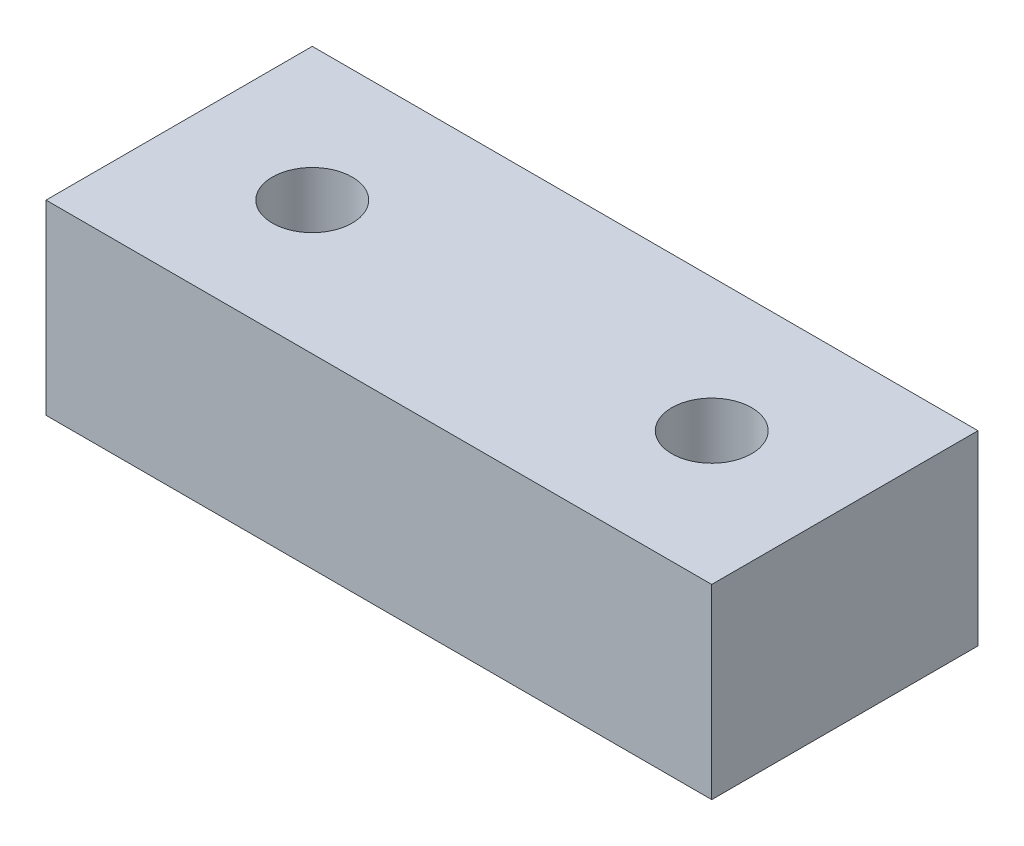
ISO-10303-21;
HEADER;
FILE_DESCRIPTION(('STEP AP214'),'2;1');
FILE_NAME('part.step','',(''),(''),'','','');
FILE_SCHEMA(('AUTOMOTIVE_DESIGN { 1 0 10303 214 1 1 1 1 }'));
ENDSEC;
DATA;
#1=APPLICATION_CONTEXT('core data for automotive mechanical design processes');
#2=APPLICATION_PROTOCOL_DEFINITION('international standard','automotive_design',2000,#1);
#3=PRODUCT_CONTEXT('',#1,'mechanical');
#4=PRODUCT('Part','Part','',(#3));
#5=PRODUCT_RELATED_PRODUCT_CATEGORY('part','',(#4));
#6=PRODUCT_DEFINITION_FORMATION('','',#4);
#7=PRODUCT_DEFINITION_CONTEXT('part definition',#1,'design');
#8=PRODUCT_DEFINITION('design','',#6,#7);
#9=PRODUCT_DEFINITION_SHAPE('','',#8);
#10=(LENGTH_UNIT() NAMED_UNIT(*) SI_UNIT(.MILLI.,.METRE.));
#11=(NAMED_UNIT(*) PLANE_ANGLE_UNIT() SI_UNIT($,.RADIAN.));
#12=(NAMED_UNIT(*) SI_UNIT($,.STERADIAN.) SOLID_ANGLE_UNIT());
#13=UNCERTAINTY_MEASURE_WITH_UNIT(LENGTH_MEASURE(1.E-05),#10,'distance_accuracy_value','');
#14=(GEOMETRIC_REPRESENTATION_CONTEXT(3) GLOBAL_UNCERTAINTY_ASSIGNED_CONTEXT((#13)) GLOBAL_UNIT_ASSIGNED_CONTEXT((#10,
#11,#12)) REPRESENTATION_CONTEXT('',''));
#15=CARTESIAN_POINT('',(0.,0.,0.));
#16=DIRECTION('',(0.,0.,1.));
#17=DIRECTION('',(1.,0.,0.));
#18=AXIS2_PLACEMENT_3D('',#15,#16,#17);
#19=CARTESIAN_POINT('',(0.,5.99999999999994,20.));
#20=DIRECTION('',(0.,1.,0.));
#21=DIRECTION('',(-1.,0.,0.));
#22=AXIS2_PLACEMENT_3D('',#19,#20,#21);
#23=PLANE('',#22);
#24=CARTESIAN_POINT('',(15.,5.99999999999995,10.));
#25=DIRECTION('',(0.,-1.,0.));
#26=DIRECTION('',(0.,0.,-1.));
#27=AXIS2_PLACEMENT_3D('',#24,#25,#26);
#28=CIRCLE('',#27,5.5);
#29=CARTESIAN_POINT('',(15.,5.99999999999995,4.50000000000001));
#30=VERTEX_POINT('',#29);
#31=EDGE_CURVE('E112',#30,#30,#28,.T.);
#32=ORIENTED_EDGE('',*,*,#31,.F.);
#33=EDGE_LOOP('',(#32));
#34=FACE_BOUND('',#33,.T.);
#35=DIRECTION('',(0.,0.,-1.));
#36=VECTOR('',#35,1.);
#37=CARTESIAN_POINT('',(25.,5.99999999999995,20.));
#38=LINE('',#37,#36);
#39=CARTESIAN_POINT('',(25.,5.99999999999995,20.));
#40=VERTEX_POINT('',#39);
#41=CARTESIAN_POINT('',(25.,5.99999999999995,0.));
#42=VERTEX_POINT('',#41);
#43=EDGE_CURVE('E11',#40,#42,#38,.T.);
#44=ORIENTED_EDGE('',*,*,#43,.F.);
#45=DIRECTION('',(-1.,0.,0.));
#46=VECTOR('',#45,1.);
#47=CARTESIAN_POINT('',(0.,5.99999999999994,20.));
#48=LINE('',#47,#46);
#49=CARTESIAN_POINT('',(-25.,5.99999999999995,20.));
#50=VERTEX_POINT('',#49);
#51=EDGE_CURVE('E43',#40,#50,#48,.T.);
#52=ORIENTED_EDGE('',*,*,#51,.T.);
#53=DIRECTION('',(0.,0.,-1.));
#54=VECTOR('',#53,1.);
#55=CARTESIAN_POINT('',(-25.,5.99999999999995,20.));
#56=LINE('',#55,#54);
#57=CARTESIAN_POINT('',(-25.,5.99999999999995,0.));
#58=VERTEX_POINT('',#57);
#59=EDGE_CURVE('E81',#50,#58,#56,.T.);
#60=ORIENTED_EDGE('',*,*,#59,.T.);
#61=DIRECTION('',(1.,0.,0.));
#62=VECTOR('',#61,1.);
#63=CARTESIAN_POINT('',(0.,5.99999999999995,0.));
#64=LINE('',#63,#62);
#65=EDGE_CURVE('E71',#58,#42,#64,.T.);
#66=ORIENTED_EDGE('',*,*,#65,.T.);
#67=EDGE_LOOP('',(#44,#52,#60,#66));
#68=FACE_BOUND('',#67,.T.);
#69=CARTESIAN_POINT('',(-15.,5.99999999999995,10.));
#70=DIRECTION('',(0.,-1.,0.));
#71=DIRECTION('',(0.,0.,-1.));
#72=AXIS2_PLACEMENT_3D('',#69,#70,#71);
#73=CIRCLE('',#72,5.5);
#74=CARTESIAN_POINT('',(-15.,5.99999999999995,4.50000000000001));
#75=VERTEX_POINT('',#74);
#76=EDGE_CURVE('E121',#75,#75,#73,.T.);
#77=ORIENTED_EDGE('',*,*,#76,.F.);
#78=EDGE_LOOP('',(#77));
#79=FACE_BOUND('',#78,.T.);
#80=ADVANCED_FACE('F29',(#34,#68,#79),#23,.F.);
#81=CARTESIAN_POINT('',(25.,19.9999999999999,20.));
#82=DIRECTION('',(0.,-1.,0.));
#83=DIRECTION('',(0.,0.,-1.));
#84=AXIS2_PLACEMENT_3D('',#81,#82,#83);
#85=PLANE('',#84);
#86=CARTESIAN_POINT('',(15.,20.,10.));
#87=DIRECTION('',(0.,-1.,0.));
#88=DIRECTION('',(0.,0.,-1.));
#89=AXIS2_PLACEMENT_3D('',#86,#87,#88);
#90=CIRCLE('',#89,3.);
#91=CARTESIAN_POINT('',(15.,20.,7.00000000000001));
#92=VERTEX_POINT('',#91);
#93=EDGE_CURVE('E90',#92,#92,#90,.T.);
#94=ORIENTED_EDGE('',*,*,#93,.T.);
#95=EDGE_LOOP('',(#94));
#96=FACE_BOUND('',#95,.T.);
#97=DIRECTION('',(0.,0.,-1.));
#98=VECTOR('',#97,1.);
#99=CARTESIAN_POINT('',(-25.,19.9999999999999,20.));
#100=LINE('',#99,#98);
#101=CARTESIAN_POINT('',(-25.,19.9999999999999,20.));
#102=VERTEX_POINT('',#101);
#103=CARTESIAN_POINT('',(-25.,19.9999999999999,0.));
#104=VERTEX_POINT('',#103);
#105=EDGE_CURVE('E85',#102,#104,#100,.T.);
#106=ORIENTED_EDGE('',*,*,#105,.F.);
#107=DIRECTION('',(-1.,0.,0.));
#108=VECTOR('',#107,1.);
#109=CARTESIAN_POINT('',(25.,19.9999999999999,20.));
#110=LINE('',#109,#108);
#111=CARTESIAN_POINT('',(25.,19.9999999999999,20.));
#112=VERTEX_POINT('',#111);
#113=EDGE_CURVE('E99',#112,#102,#110,.T.);
#114=ORIENTED_EDGE('',*,*,#113,.F.);
#115=DIRECTION('',(0.,0.,-1.));
#116=VECTOR('',#115,1.);
#117=CARTESIAN_POINT('',(25.,19.9999999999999,20.));
#118=LINE('',#117,#116);
#119=CARTESIAN_POINT('',(25.,20.,0.));
#120=VERTEX_POINT('',#119);
#121=EDGE_CURVE('E36',#112,#120,#118,.T.);
#122=ORIENTED_EDGE('',*,*,#121,.T.);
#123=DIRECTION('',(-1.,0.,0.));
#124=VECTOR('',#123,1.);
#125=CARTESIAN_POINT('',(25.,20.,0.));
#126=LINE('',#125,#124);
#127=EDGE_CURVE('E89',#120,#104,#126,.T.);
#128=ORIENTED_EDGE('',*,*,#127,.T.);
#129=EDGE_LOOP('',(#106,#114,#122,#128));
#130=FACE_BOUND('',#129,.T.);
#131=CARTESIAN_POINT('',(-15.,20.,10.));
#132=DIRECTION('',(0.,-1.,0.));
#133=DIRECTION('',(0.,0.,-1.));
#134=AXIS2_PLACEMENT_3D('',#131,#132,#133);
#135=CIRCLE('',#134,3.);
#136=CARTESIAN_POINT('',(-15.,20.,7.00000000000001));
#137=VERTEX_POINT('',#136);
#138=EDGE_CURVE('E115',#137,#137,#135,.T.);
#139=ORIENTED_EDGE('',*,*,#138,.T.);
#140=EDGE_LOOP('',(#139));
#141=FACE_BOUND('',#140,.T.);
#142=ADVANCED_FACE('F106',(#96,#130,#141),#85,.F.);
#143=CARTESIAN_POINT('',(25.,5.99999999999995,20.));
#144=DIRECTION('',(-1.,0.,0.));
#145=DIRECTION('',(0.,0.,1.));
#146=AXIS2_PLACEMENT_3D('',#143,#144,#145);
#147=PLANE('',#146);
#148=ORIENTED_EDGE('',*,*,#121,.F.);
#149=DIRECTION('',(0.,1.,0.));
#150=VECTOR('',#149,1.);
#151=CARTESIAN_POINT('',(25.,5.99999999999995,20.));
#152=LINE('',#151,#150);
#153=EDGE_CURVE('E86',#40,#112,#152,.T.);
#154=ORIENTED_EDGE('',*,*,#153,.F.);
#155=ORIENTED_EDGE('',*,*,#43,.T.);
#156=DIRECTION('',(0.,1.,0.));
#157=VECTOR('',#156,1.);
#158=CARTESIAN_POINT('',(25.,5.99999999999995,0.));
#159=LINE('',#158,#157);
#160=EDGE_CURVE('E78',#42,#120,#159,.T.);
#161=ORIENTED_EDGE('',*,*,#160,.T.);
#162=EDGE_LOOP('',(#148,#154,#155,#161));
#163=FACE_BOUND('',#162,.T.);
#164=ADVANCED_FACE('F108',(#163),#147,.F.);
#165=CARTESIAN_POINT('',(-25.,5.99999999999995,20.));
#166=DIRECTION('',(-1.,0.,0.));
#167=DIRECTION('',(0.,0.,1.));
#168=AXIS2_PLACEMENT_3D('',#165,#166,#167);
#169=PLANE('',#168);
#170=DIRECTION('',(0.,1.,0.));
#171=VECTOR('',#170,1.);
#172=CARTESIAN_POINT('',(-25.,5.99999999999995,20.));
#173=LINE('',#172,#171);
#174=EDGE_CURVE('E102',#50,#102,#173,.T.);
#175=ORIENTED_EDGE('',*,*,#174,.T.);
#176=ORIENTED_EDGE('',*,*,#105,.T.);
#177=DIRECTION('',(0.,1.,0.));
#178=VECTOR('',#177,1.);
#179=CARTESIAN_POINT('',(-25.,5.99999999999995,0.));
#180=LINE('',#179,#178);
#181=EDGE_CURVE('E76',#58,#104,#180,.T.);
#182=ORIENTED_EDGE('',*,*,#181,.F.);
#183=ORIENTED_EDGE('',*,*,#59,.F.);
#184=EDGE_LOOP('',(#175,#176,#182,#183));
#185=FACE_BOUND('',#184,.T.);
#186=ADVANCED_FACE('F88',(#185),#169,.T.);
#187=CARTESIAN_POINT('',(-25.,5.99999999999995,20.));
#188=DIRECTION('',(0.,0.,-1.));
#189=DIRECTION('',(-1.,0.,0.));
#190=AXIS2_PLACEMENT_3D('',#187,#188,#189);
#191=PLANE('',#190);
#192=ORIENTED_EDGE('',*,*,#51,.F.);
#193=ORIENTED_EDGE('',*,*,#153,.T.);
#194=ORIENTED_EDGE('',*,*,#113,.T.);
#195=ORIENTED_EDGE('',*,*,#174,.F.);
#196=EDGE_LOOP('',(#192,#193,#194,#195));
#197=FACE_BOUND('',#196,.T.);
#198=ADVANCED_FACE('F151',(#197),#191,.F.);
#199=CARTESIAN_POINT('',(-25.,5.99999999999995,0.));
#200=DIRECTION('',(0.,0.,-1.));
#201=DIRECTION('',(-1.,0.,0.));
#202=AXIS2_PLACEMENT_3D('',#199,#200,#201);
#203=PLANE('',#202);
#204=ORIENTED_EDGE('',*,*,#65,.F.);
#205=ORIENTED_EDGE('',*,*,#181,.T.);
#206=ORIENTED_EDGE('',*,*,#127,.F.);
#207=ORIENTED_EDGE('',*,*,#160,.F.);
#208=EDGE_LOOP('',(#204,#205,#206,#207));
#209=FACE_BOUND('',#208,.T.);
#210=ADVANCED_FACE('F73',(#209),#203,.T.);
#211=CARTESIAN_POINT('',(15.,5.99999999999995,10.));
#212=DIRECTION('',(0.,-1.,0.));
#213=DIRECTION('',(0.,0.,-1.));
#214=AXIS2_PLACEMENT_3D('',#211,#212,#213);
#215=CYLINDRICAL_SURFACE('',#214,3.);
#216=CARTESIAN_POINT('',(15.,8.49999999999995,10.));
#217=DIRECTION('',(0.,-1.,0.));
#218=DIRECTION('',(0.,0.,-1.));
#219=AXIS2_PLACEMENT_3D('',#216,#217,#218);
#220=CIRCLE('',#219,3.);
#221=CARTESIAN_POINT('',(15.,8.49999999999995,7.00000000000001));
#222=VERTEX_POINT('',#221);
#223=EDGE_CURVE('E94',#222,#222,#220,.T.);
#224=ORIENTED_EDGE('',*,*,#223,.T.);
#225=EDGE_LOOP('',(#224));
#226=FACE_BOUND('',#225,.T.);
#227=ORIENTED_EDGE('',*,*,#93,.F.);
#228=EDGE_LOOP('',(#227));
#229=FACE_BOUND('',#228,.T.);
#230=ADVANCED_FACE('F140',(#226,#229),#215,.F.);
#231=CARTESIAN_POINT('',(15.,8.49999999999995,10.));
#232=DIRECTION('',(0.,-1.,0.));
#233=DIRECTION('',(0.,0.,-1.));
#234=AXIS2_PLACEMENT_3D('',#231,#232,#233);
#235=CONICAL_SURFACE('',#234,3.,0.78539816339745);
#236=ORIENTED_EDGE('',*,*,#31,.T.);
#237=EDGE_LOOP('',(#236));
#238=FACE_BOUND('',#237,.T.);
#239=ORIENTED_EDGE('',*,*,#223,.F.);
#240=EDGE_LOOP('',(#239));
#241=FACE_BOUND('',#240,.T.);
#242=ADVANCED_FACE('F136',(#238,#241),#235,.F.);
#243=CARTESIAN_POINT('',(-15.,5.99999999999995,10.));
#244=DIRECTION('',(0.,-1.,0.));
#245=DIRECTION('',(0.,0.,-1.));
#246=AXIS2_PLACEMENT_3D('',#243,#244,#245);
#247=CYLINDRICAL_SURFACE('',#246,3.);
#248=CARTESIAN_POINT('',(-15.,8.49999999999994,10.));
#249=DIRECTION('',(0.,-1.,0.));
#250=DIRECTION('',(0.,0.,-1.));
#251=AXIS2_PLACEMENT_3D('',#248,#249,#250);
#252=CIRCLE('',#251,3.);
#253=CARTESIAN_POINT('',(-15.,8.49999999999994,7.00000000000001));
#254=VERTEX_POINT('',#253);
#255=EDGE_CURVE('E118',#254,#254,#252,.T.);
#256=ORIENTED_EDGE('',*,*,#255,.T.);
#257=EDGE_LOOP('',(#256));
#258=FACE_BOUND('',#257,.T.);
#259=ORIENTED_EDGE('',*,*,#138,.F.);
#260=EDGE_LOOP('',(#259));
#261=FACE_BOUND('',#260,.T.);
#262=ADVANCED_FACE('F139',(#258,#261),#247,.F.);
#263=CARTESIAN_POINT('',(-15.,8.49999999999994,10.));
#264=DIRECTION('',(0.,-1.,0.));
#265=DIRECTION('',(0.,0.,-1.));
#266=AXIS2_PLACEMENT_3D('',#263,#264,#265);
#267=CONICAL_SURFACE('',#266,3.,0.78539816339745);
#268=ORIENTED_EDGE('',*,*,#76,.T.);
#269=EDGE_LOOP('',(#268));
#270=FACE_BOUND('',#269,.T.);
#271=ORIENTED_EDGE('',*,*,#255,.F.);
#272=EDGE_LOOP('',(#271));
#273=FACE_BOUND('',#272,.T.);
#274=ADVANCED_FACE('F125',(#270,#273),#267,.F.);
#275=CLOSED_SHELL('',(#80,#142,#164,#186,#198,#210,#230,#242,#262,#274));
#276=MANIFOLD_SOLID_BREP('B2',#275);
#277=ADVANCED_BREP_SHAPE_REPRESENTATION('',(#18,#276),#14);
#278=SHAPE_DEFINITION_REPRESENTATION(#9,#277);
ENDSEC;
END-ISO-10303-21;
